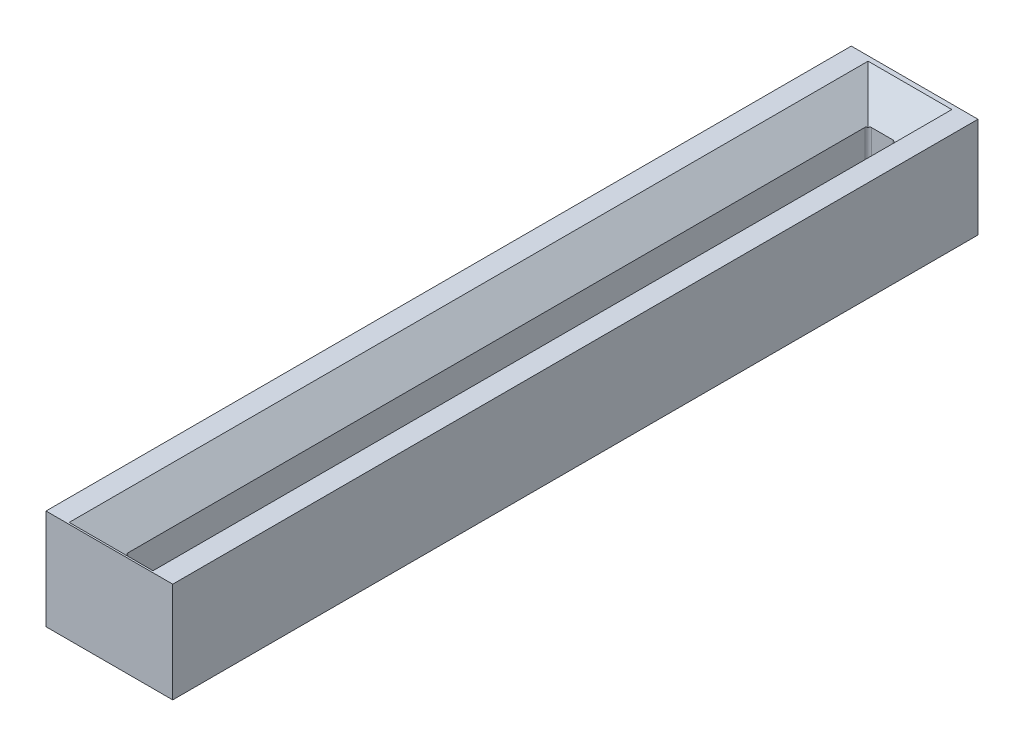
from build123d import *

# Parameters (mm, degrees)
SKETCH2_W               = 513.65
SKETCH2_H               = 3412.05
SKETCH2_W_2             = 113.6
SKETCH2_H_2             = 3012
BOSS_EXTRUDE2_DEPTH     = 203.2
CHAMFER1_SIZE           = 113
FILLET1_R               = 13
CUT_EXTRUDE1_DEPTH      = 1738.173169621
CUT_EXTRUDE1_DEPTH_BACK = 1738.173169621
SKETCH4_W               = 1378.84089901
SKETCH4_H               = 273.913679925
SKETCH4_W_2             = 856.554224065
SKETCH4_H_2             = 287.587011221


with BuildPart() as part:
    # Sketch2 → Boss-Extrude2 (new, symmetric)
    with BuildSketch(Plane(origin=(0, 0, 0), x_dir=(-1, 0, 0), z_dir=(0, 1, 0))):
        Rectangle(SKETCH2_W, SKETCH2_H)
        Rectangle(SKETCH2_W_2, SKETCH2_H_2, mode=Mode.SUBTRACT)
    extrude(amount=BOSS_EXTRUDE2_DEPTH, both=True)

    # Chamfer1
    chamfer1_edges = [part.edges().sort_by_distance(p)[0] for p in [
        (-56.8, -203.2, 0),
        (0, -203.2, 1506),
        (56.8, -203.2, 0),
        (0, -203.2, -1506),
        (-56.8, 203.2, 0),
        (0, 203.2, 1506),
        (56.8, 203.2, 0),
        (0, 203.2, -1506),
    ]]
    chamfer(chamfer1_edges, length=CHAMFER1_SIZE)

    # Fillet1
    fillet1_edges = [part.edges().sort_by_distance(p)[0] for p in [
        (56.8, 0, 1506),
        (56.8, 0, -1506),
        (-56.8, 0, -1506),
        (-56.8, 0, 1506),
    ]]
    fillet(fillet1_edges, radius=FILLET1_R)

    # Sketch4 → Cut-Extrude1 (cut, two sides: drawn at the far end of the back side and taken through both)
    with BuildSketch(Plane(origin=(0, 0, 0), x_dir=(-1, 0, 0), z_dir=(0, 1, 0)).offset(-CUT_EXTRUDE1_DEPTH_BACK)):
        with Locations((110.223079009, -1774.956839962)):
            Rectangle(SKETCH4_W, SKETCH4_H)
        with Locations((-6.761944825, 1769.793505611)):
            Rectangle(SKETCH4_W_2, SKETCH4_H_2)
    extrude(amount=CUT_EXTRUDE1_DEPTH + CUT_EXTRUDE1_DEPTH_BACK, mode=Mode.SUBTRACT)


solid = part.part
